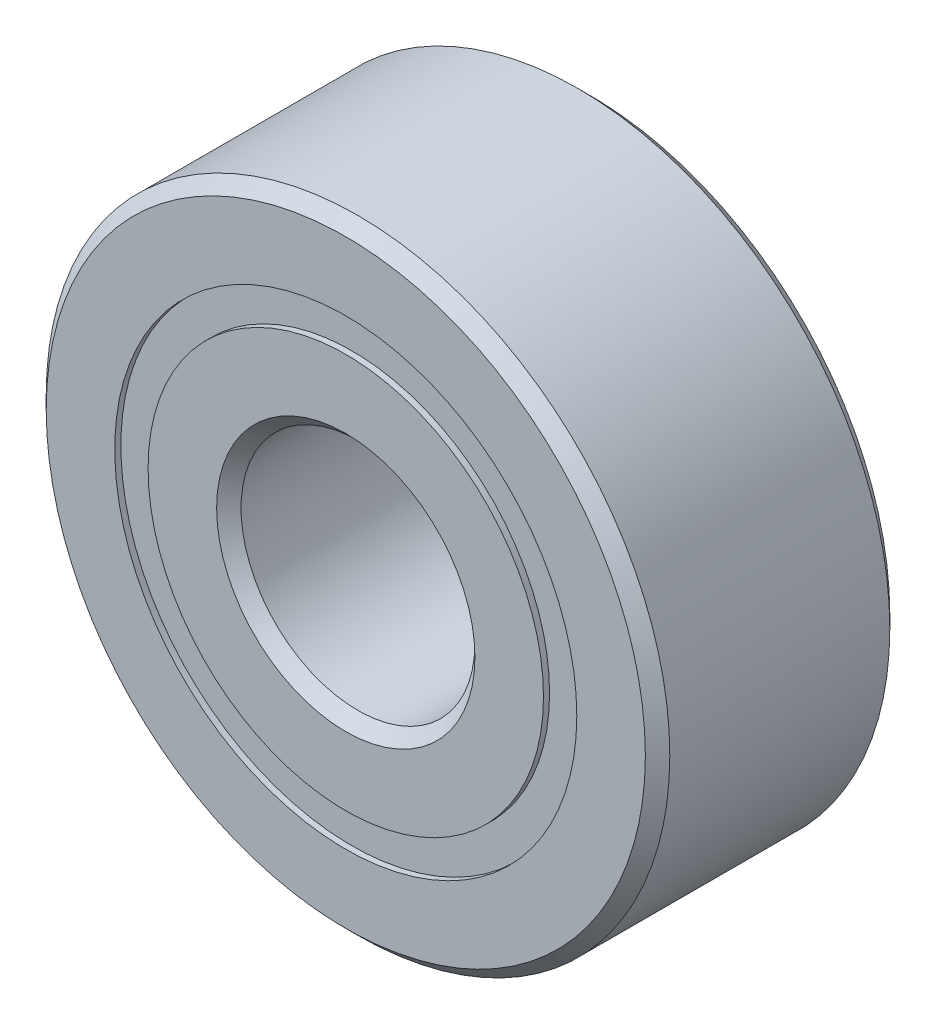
from build123d import *

# Parameters (mm, degrees)
CIRPATTERN1_COUNT = 8
SKETCH5_W         = 1.207534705
SKETCH5_H         = 0.678821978


with BuildPart() as part:
    # Sketch1 → Revolve1 (revolve)
    with BuildSketch(Plane(origin=(0, 0, 0), x_dir=(0, 0, -1), z_dir=(1, 0, 0)), mode=Mode.PRIVATE) as revolve1_sk:
        with BuildLine():
            Line((2.24028, 6.35), (-2.24028, 6.35))
            Line((-2.24028, 6.35), (-2.4892, 6.10108))
            Line((-2.4892, 6.10108), (-2.4892, 4.705035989))
            Line((-2.4892, 4.705035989), (-1.106311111, 4.705035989))
            ThreePointArc((-1.106311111, 4.705035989), (0, 5.522830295), (1.106311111, 4.705035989))
            Line((1.106311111, 4.705035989), (2.4892, 4.705035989))
            Line((2.4892, 4.705035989), (2.4892, 6.10108))
            Line((2.4892, 6.10108), (2.24028, 6.35))
        make_face()
    revolve(revolve1_sk.sketch.rotate(Axis((0, 0, 2.4892), (0, 0, -1)), 90), axis=Axis((0, 0, 2.4892), (0, 0, -1)))


with BuildPart() as body_2:
    # Sketch3 → Revolve3 (revolve)
    with BuildSketch(Plane(origin=(0, 0, 0), x_dir=(0, 0, -1), z_dir=(1, 0, 0)), mode=Mode.PRIVATE) as revolve3_sk:
        with BuildLine():
            Line((-2.4892, 4.026214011), (-1.106311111, 4.026214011))
            ThreePointArc((-1.106311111, 4.026214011), (0, 3.208419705), (1.106311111, 4.026214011))
            Line((1.106311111, 4.026214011), (2.4892, 4.026214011))
            Line((2.4892, 4.026214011), (2.4892, 2.63017))
            Line((2.4892, 2.63017), (2.24028, 2.38125))
            Line((2.24028, 2.38125), (-2.24028, 2.38125))
            Line((-2.24028, 2.38125), (-2.4892, 2.63017))
            Line((-2.4892, 2.63017), (-2.4892, 4.026214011))
        make_face()
    revolve(revolve3_sk.sketch.rotate(Axis((0, 0, 2.4892), (0, 0, -1)), 90), axis=Axis((0, 0, 2.4892), (0, 0, -1)))


with BuildPart() as body_3:
    # Sketch4 → Revolve4 (revolve)
    with BuildSketch(Plane(origin=(0, 0, 0), x_dir=(0, 0, -1), z_dir=(1, 0, 0))):
        with BuildLine():
            Line((-1.157205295, 4.365625), (1.157205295, 4.365625))
            ThreePointArc((1.157205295, 4.365625), (0, 5.522830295), (-1.157205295, 4.365625))
        make_face()
    revolve(axis=Axis((0, 4.365625, 1.157205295), (0, 0, -1)))


with BuildPart() as cirpattern1_1:
    # CirPattern1: pattern copy
    add(body_3.part.rotate(Axis((0, 0, 0), (0, 0, 1)), 1 * 360 / CIRPATTERN1_COUNT))


with BuildPart() as cirpattern1_2:
    # CirPattern1: pattern copy
    add(body_3.part.rotate(Axis((0, 0, 0), (0, 0, 1)), 2 * 360 / CIRPATTERN1_COUNT))


with BuildPart() as cirpattern1_3:
    # CirPattern1: pattern copy
    add(body_3.part.rotate(Axis((0, 0, 0), (0, 0, 1)), 3 * 360 / CIRPATTERN1_COUNT))


with BuildPart() as cirpattern1_4:
    # CirPattern1: pattern copy
    add(body_3.part.rotate(Axis((0, 0, 0), (0, 0, 1)), 4 * 360 / CIRPATTERN1_COUNT))


with BuildPart() as cirpattern1_5:
    # CirPattern1: pattern copy
    add(body_3.part.rotate(Axis((0, 0, 0), (0, 0, 1)), 5 * 360 / CIRPATTERN1_COUNT))


with BuildPart() as cirpattern1_6:
    # CirPattern1: pattern copy
    add(body_3.part.rotate(Axis((0, 0, 0), (0, 0, 1)), 6 * 360 / CIRPATTERN1_COUNT))


with BuildPart() as cirpattern1_7:
    # CirPattern1: pattern copy
    add(body_3.part.rotate(Axis((0, 0, 0), (0, 0, 1)), 7 * 360 / CIRPATTERN1_COUNT))


with BuildPart() as body_11:
    # Sketch5 → Revolve5 (revolve)
    with BuildSketch(Plane(origin=(0, 0, 0), x_dir=(0, 0, -1), z_dir=(1, 0, 0)), mode=Mode.PRIVATE) as revolve5_sk:
        with Locations((-1.760972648, 4.365625)):
            Rectangle(SKETCH5_W, SKETCH5_H)
        with Locations((1.760972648, 4.365625)):
            Rectangle(SKETCH5_W, SKETCH5_H)
    revolve(revolve5_sk.sketch.rotate(Axis((0, 0, 2.4892), (0, 0, -1)), 90), axis=Axis((0, 0, 2.4892), (0, 0, -1)))


solid = Compound([part.part, body_2.part, body_3.part, cirpattern1_1.part, cirpattern1_2.part, cirpattern1_3.part, cirpattern1_4.part, cirpattern1_5.part, cirpattern1_6.part, cirpattern1_7.part, body_11.part])
